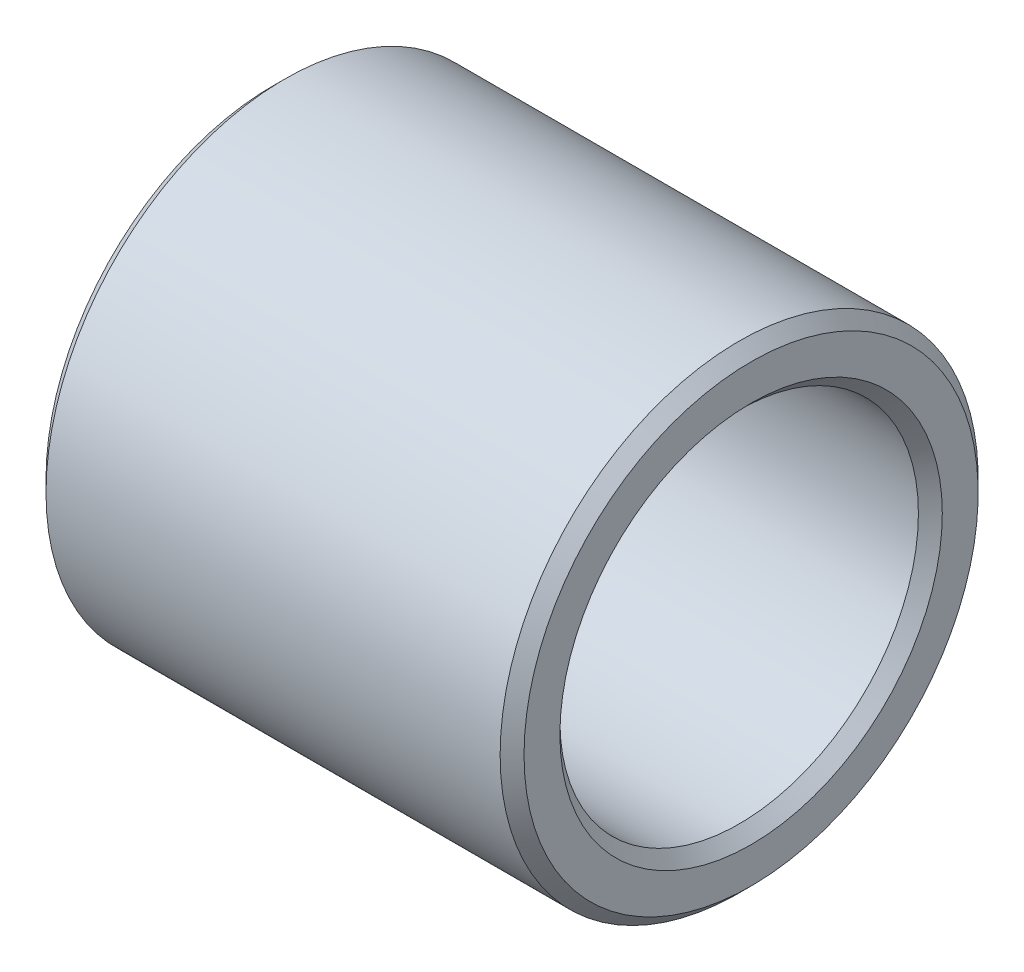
ISO-10303-21;
HEADER;
FILE_DESCRIPTION(('STEP AP214'),'2;1');
FILE_NAME('part.step','',(''),(''),'','','');
FILE_SCHEMA(('AUTOMOTIVE_DESIGN { 1 0 10303 214 1 1 1 1 }'));
ENDSEC;
DATA;
#1=APPLICATION_CONTEXT('core data for automotive mechanical design processes');
#2=APPLICATION_PROTOCOL_DEFINITION('international standard','automotive_design',2000,#1);
#3=PRODUCT_CONTEXT('',#1,'mechanical');
#4=PRODUCT('Part','Part','',(#3));
#5=PRODUCT_RELATED_PRODUCT_CATEGORY('part','',(#4));
#6=PRODUCT_DEFINITION_FORMATION('','',#4);
#7=PRODUCT_DEFINITION_CONTEXT('part definition',#1,'design');
#8=PRODUCT_DEFINITION('design','',#6,#7);
#9=PRODUCT_DEFINITION_SHAPE('','',#8);
#10=(LENGTH_UNIT() NAMED_UNIT(*) SI_UNIT(.MILLI.,.METRE.));
#11=(NAMED_UNIT(*) PLANE_ANGLE_UNIT() SI_UNIT($,.RADIAN.));
#12=(NAMED_UNIT(*) SI_UNIT($,.STERADIAN.) SOLID_ANGLE_UNIT());
#13=UNCERTAINTY_MEASURE_WITH_UNIT(LENGTH_MEASURE(1.E-05),#10,'distance_accuracy_value','');
#14=(GEOMETRIC_REPRESENTATION_CONTEXT(3) GLOBAL_UNCERTAINTY_ASSIGNED_CONTEXT((#13)) GLOBAL_UNIT_ASSIGNED_CONTEXT((#10,
#11,#12)) REPRESENTATION_CONTEXT('',''));
#15=CARTESIAN_POINT('',(0.,0.,0.));
#16=DIRECTION('',(0.,0.,1.));
#17=DIRECTION('',(1.,0.,0.));
#18=AXIS2_PLACEMENT_3D('',#15,#16,#17);
#19=CARTESIAN_POINT('',(-8.,0.,0.));
#20=DIRECTION('',(-1.,0.,0.));
#21=DIRECTION('',(0.,0.,1.));
#22=AXIS2_PLACEMENT_3D('',#19,#20,#21);
#23=CONICAL_SURFACE('',#22,6.4,0.78539816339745);
#24=CARTESIAN_POINT('',(-7.6,0.,0.));
#25=DIRECTION('',(-1.,0.,0.));
#26=DIRECTION('',(0.,0.,1.));
#27=AXIS2_PLACEMENT_3D('',#24,#25,#26);
#28=CIRCLE('',#27,6.);
#29=CARTESIAN_POINT('',(-7.6,0.,6.));
#30=VERTEX_POINT('',#29);
#31=EDGE_CURVE('E10',#30,#30,#28,.T.);
#32=ORIENTED_EDGE('',*,*,#31,.F.);
#33=EDGE_LOOP('',(#32));
#34=FACE_BOUND('',#33,.T.);
#35=CARTESIAN_POINT('',(-8.,0.,0.));
#36=DIRECTION('',(-1.,0.,0.));
#37=DIRECTION('',(0.,0.,1.));
#38=AXIS2_PLACEMENT_3D('',#35,#36,#37);
#39=CIRCLE('',#38,6.4);
#40=CARTESIAN_POINT('',(-8.,0.,6.4));
#41=VERTEX_POINT('',#40);
#42=EDGE_CURVE('E56',#41,#41,#39,.T.);
#43=ORIENTED_EDGE('',*,*,#42,.T.);
#44=EDGE_LOOP('',(#43));
#45=FACE_BOUND('',#44,.T.);
#46=ADVANCED_FACE('F28',(#34,#45),#23,.F.);
#47=CARTESIAN_POINT('',(0.,0.,0.));
#48=DIRECTION('',(-1.,0.,0.));
#49=DIRECTION('',(0.,0.,1.));
#50=AXIS2_PLACEMENT_3D('',#47,#48,#49);
#51=CYLINDRICAL_SURFACE('',#50,6.);
#52=CARTESIAN_POINT('',(7.6,0.,0.));
#53=DIRECTION('',(-1.,0.,0.));
#54=DIRECTION('',(0.,0.,1.));
#55=AXIS2_PLACEMENT_3D('',#52,#53,#54);
#56=CIRCLE('',#55,6.);
#57=CARTESIAN_POINT('',(7.6,0.,6.));
#58=VERTEX_POINT('',#57);
#59=EDGE_CURVE('E34',#58,#58,#56,.T.);
#60=ORIENTED_EDGE('',*,*,#59,.F.);
#61=EDGE_LOOP('',(#60));
#62=FACE_BOUND('',#61,.T.);
#63=ORIENTED_EDGE('',*,*,#31,.T.);
#64=EDGE_LOOP('',(#63));
#65=FACE_BOUND('',#64,.T.);
#66=ADVANCED_FACE('F93',(#62,#65),#51,.F.);
#67=CARTESIAN_POINT('',(7.6,0.,0.));
#68=DIRECTION('',(1.,0.,0.));
#69=DIRECTION('',(0.,0.,-1.));
#70=AXIS2_PLACEMENT_3D('',#67,#68,#69);
#71=CONICAL_SURFACE('',#70,6.,0.785398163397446);
#72=CARTESIAN_POINT('',(8.,0.,0.));
#73=DIRECTION('',(-1.,0.,0.));
#74=DIRECTION('',(0.,0.,1.));
#75=AXIS2_PLACEMENT_3D('',#72,#73,#74);
#76=CIRCLE('',#75,6.4);
#77=CARTESIAN_POINT('',(8.,0.,6.4));
#78=VERTEX_POINT('',#77);
#79=EDGE_CURVE('E38',#78,#78,#76,.T.);
#80=ORIENTED_EDGE('',*,*,#79,.F.);
#81=EDGE_LOOP('',(#80));
#82=FACE_BOUND('',#81,.T.);
#83=ORIENTED_EDGE('',*,*,#59,.T.);
#84=EDGE_LOOP('',(#83));
#85=FACE_BOUND('',#84,.T.);
#86=ADVANCED_FACE('F88',(#82,#85),#71,.F.);
#87=CARTESIAN_POINT('',(8.,7.6,0.));
#88=DIRECTION('',(-1.,0.,0.));
#89=DIRECTION('',(0.,0.,1.));
#90=AXIS2_PLACEMENT_3D('',#87,#88,#89);
#91=PLANE('',#90);
#92=CARTESIAN_POINT('',(8.,0.,0.));
#93=DIRECTION('',(-1.,0.,0.));
#94=DIRECTION('',(0.,0.,1.));
#95=AXIS2_PLACEMENT_3D('',#92,#93,#94);
#96=CIRCLE('',#95,7.6);
#97=CARTESIAN_POINT('',(8.,0.,7.6));
#98=VERTEX_POINT('',#97);
#99=EDGE_CURVE('E42',#98,#98,#96,.T.);
#100=ORIENTED_EDGE('',*,*,#99,.F.);
#101=EDGE_LOOP('',(#100));
#102=FACE_BOUND('',#101,.T.);
#103=ORIENTED_EDGE('',*,*,#79,.T.);
#104=EDGE_LOOP('',(#103));
#105=FACE_BOUND('',#104,.T.);
#106=ADVANCED_FACE('F82',(#102,#105),#91,.F.);
#107=CARTESIAN_POINT('',(8.,0.,0.));
#108=DIRECTION('',(-1.,0.,0.));
#109=DIRECTION('',(0.,0.,1.));
#110=AXIS2_PLACEMENT_3D('',#107,#108,#109);
#111=CONICAL_SURFACE('',#110,7.6,0.785398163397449);
#112=CARTESIAN_POINT('',(7.6,0.,0.));
#113=DIRECTION('',(-1.,0.,0.));
#114=DIRECTION('',(0.,0.,1.));
#115=AXIS2_PLACEMENT_3D('',#112,#113,#114);
#116=CIRCLE('',#115,8.);
#117=CARTESIAN_POINT('',(7.6,0.,8.));
#118=VERTEX_POINT('',#117);
#119=EDGE_CURVE('E47',#118,#118,#116,.T.);
#120=ORIENTED_EDGE('',*,*,#119,.F.);
#121=EDGE_LOOP('',(#120));
#122=FACE_BOUND('',#121,.T.);
#123=ORIENTED_EDGE('',*,*,#99,.T.);
#124=EDGE_LOOP('',(#123));
#125=FACE_BOUND('',#124,.T.);
#126=ADVANCED_FACE('F76',(#122,#125),#111,.T.);
#127=CARTESIAN_POINT('',(0.,0.,0.));
#128=DIRECTION('',(-1.,0.,0.));
#129=DIRECTION('',(0.,0.,1.));
#130=AXIS2_PLACEMENT_3D('',#127,#128,#129);
#131=CYLINDRICAL_SURFACE('',#130,8.);
#132=CARTESIAN_POINT('',(-7.6,0.,0.));
#133=DIRECTION('',(-1.,0.,0.));
#134=DIRECTION('',(0.,0.,1.));
#135=AXIS2_PLACEMENT_3D('',#132,#133,#134);
#136=CIRCLE('',#135,8.);
#137=CARTESIAN_POINT('',(-7.6,0.,8.));
#138=VERTEX_POINT('',#137);
#139=EDGE_CURVE('E50',#138,#138,#136,.T.);
#140=ORIENTED_EDGE('',*,*,#139,.F.);
#141=EDGE_LOOP('',(#140));
#142=FACE_BOUND('',#141,.T.);
#143=ORIENTED_EDGE('',*,*,#119,.T.);
#144=EDGE_LOOP('',(#143));
#145=FACE_BOUND('',#144,.T.);
#146=ADVANCED_FACE('F70',(#142,#145),#131,.T.);
#147=CARTESIAN_POINT('',(-7.6,0.,0.));
#148=DIRECTION('',(1.,0.,0.));
#149=DIRECTION('',(0.,0.,-1.));
#150=AXIS2_PLACEMENT_3D('',#147,#148,#149);
#151=CONICAL_SURFACE('',#150,8.,0.785398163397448);
#152=CARTESIAN_POINT('',(-8.,0.,0.));
#153=DIRECTION('',(-1.,0.,0.));
#154=DIRECTION('',(0.,0.,1.));
#155=AXIS2_PLACEMENT_3D('',#152,#153,#154);
#156=CIRCLE('',#155,7.6);
#157=CARTESIAN_POINT('',(-8.,0.,7.6));
#158=VERTEX_POINT('',#157);
#159=EDGE_CURVE('E53',#158,#158,#156,.T.);
#160=ORIENTED_EDGE('',*,*,#159,.F.);
#161=EDGE_LOOP('',(#160));
#162=FACE_BOUND('',#161,.T.);
#163=ORIENTED_EDGE('',*,*,#139,.T.);
#164=EDGE_LOOP('',(#163));
#165=FACE_BOUND('',#164,.T.);
#166=ADVANCED_FACE('F64',(#162,#165),#151,.T.);
#167=CARTESIAN_POINT('',(-8.,6.4,0.));
#168=DIRECTION('',(1.,0.,0.));
#169=DIRECTION('',(0.,0.,-1.));
#170=AXIS2_PLACEMENT_3D('',#167,#168,#169);
#171=PLANE('',#170);
#172=ORIENTED_EDGE('',*,*,#42,.F.);
#173=EDGE_LOOP('',(#172));
#174=FACE_BOUND('',#173,.T.);
#175=ORIENTED_EDGE('',*,*,#159,.T.);
#176=EDGE_LOOP('',(#175));
#177=FACE_BOUND('',#176,.T.);
#178=ADVANCED_FACE('F61',(#174,#177),#171,.F.);
#179=CLOSED_SHELL('',(#46,#66,#86,#106,#126,#146,#166,#178));
#180=MANIFOLD_SOLID_BREP('B2',#179);
#181=ADVANCED_BREP_SHAPE_REPRESENTATION('',(#18,#180),#14);
#182=SHAPE_DEFINITION_REPRESENTATION(#9,#181);
ENDSEC;
END-ISO-10303-21;
